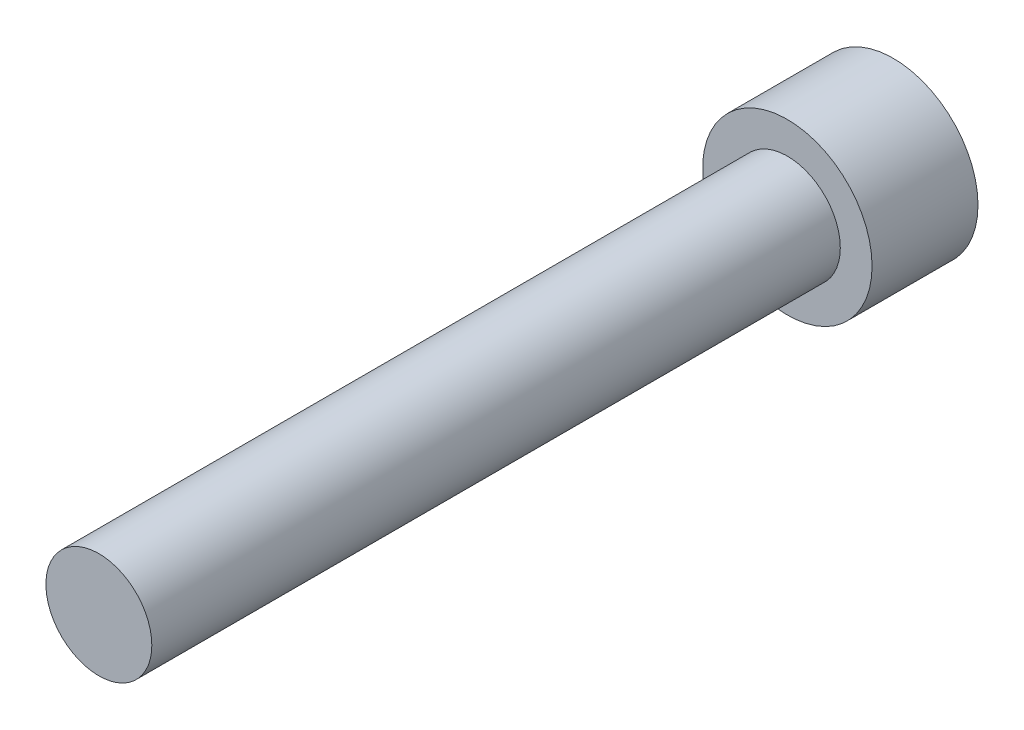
from build123d import *

# Parameters (mm, degrees)
HEX_2_DEPTH = 8


with BuildPart() as part:
    # Sketch6 → Revolve1 (revolve)
    with BuildSketch(Plane(origin=(0, 0, 0), x_dir=(0, 0, -1), z_dir=(1, 0, 0)), mode=Mode.PRIVATE) as revolve1_sk:
        Polygon((-65, 0), (-65, -5), (0, -5), (0, -8), (10, -8), (10, 0), align=None)
    revolve(revolve1_sk.sketch.rotate(Axis((0, 0, 65), (0, 0, -1)), 270), axis=Axis((0, 0, 65), (0, 0, -1)))

    # Sketch7 → HEX 2 (cut)
    with BuildSketch(Plane(origin=(0, 0, -10), x_dir=(-1, 0, 0), z_dir=(0, 0, -1))):
        Polygon((-4, 2.309401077), (-4, -2.309401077), (0, -4.618802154), (4, -2.309401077), (4, 2.309401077), (0, 4.618802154), align=None)
    extrude(amount=-HEX_2_DEPTH, mode=Mode.SUBTRACT)


solid = part.part
